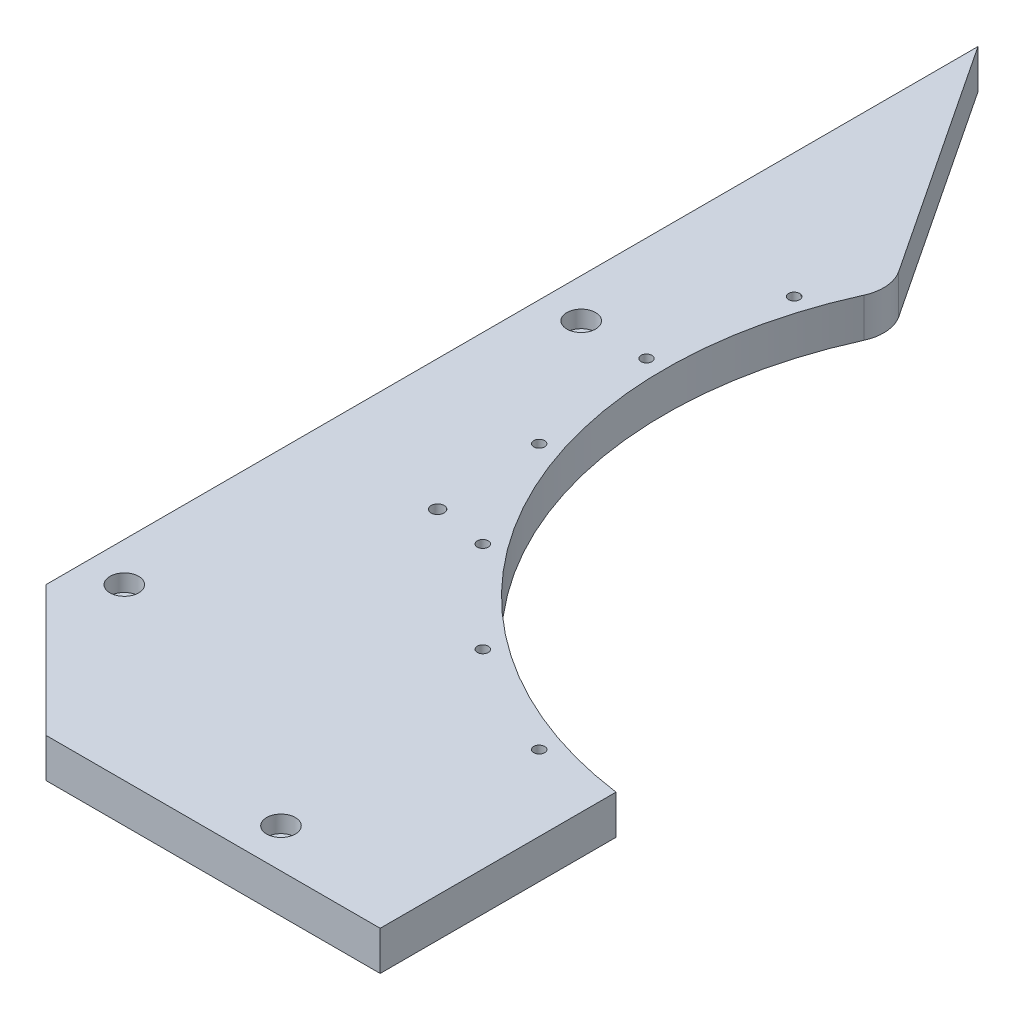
ISO-10303-21;
HEADER;
FILE_DESCRIPTION(('STEP AP214'),'2;1');
FILE_NAME('part.step','',(''),(''),'','','');
FILE_SCHEMA(('AUTOMOTIVE_DESIGN { 1 0 10303 214 1 1 1 1 }'));
ENDSEC;
DATA;
#1=APPLICATION_CONTEXT('core data for automotive mechanical design processes');
#2=APPLICATION_PROTOCOL_DEFINITION('international standard','automotive_design',2000,#1);
#3=PRODUCT_CONTEXT('',#1,'mechanical');
#4=PRODUCT('Part','Part','',(#3));
#5=PRODUCT_RELATED_PRODUCT_CATEGORY('part','',(#4));
#6=PRODUCT_DEFINITION_FORMATION('','',#4);
#7=PRODUCT_DEFINITION_CONTEXT('part definition',#1,'design');
#8=PRODUCT_DEFINITION('design','',#6,#7);
#9=PRODUCT_DEFINITION_SHAPE('','',#8);
#10=(LENGTH_UNIT() NAMED_UNIT(*) SI_UNIT(.MILLI.,.METRE.));
#11=(NAMED_UNIT(*) PLANE_ANGLE_UNIT() SI_UNIT($,.RADIAN.));
#12=(NAMED_UNIT(*) SI_UNIT($,.STERADIAN.) SOLID_ANGLE_UNIT());
#13=UNCERTAINTY_MEASURE_WITH_UNIT(LENGTH_MEASURE(1.E-05),#10,'distance_accuracy_value','');
#14=(GEOMETRIC_REPRESENTATION_CONTEXT(3) GLOBAL_UNCERTAINTY_ASSIGNED_CONTEXT((#13)) GLOBAL_UNIT_ASSIGNED_CONTEXT((#10,
#11,#12)) REPRESENTATION_CONTEXT('',''));
#15=CARTESIAN_POINT('',(0.,0.,0.));
#16=DIRECTION('',(0.,0.,1.));
#17=DIRECTION('',(1.,0.,0.));
#18=AXIS2_PLACEMENT_3D('',#15,#16,#17);
#19=CARTESIAN_POINT('',(-83.,8.5,59.9999999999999));
#20=DIRECTION('',(0.,1.,0.));
#21=DIRECTION('',(0.,0.,1.));
#22=AXIS2_PLACEMENT_3D('',#19,#20,#21);
#23=CYLINDRICAL_SURFACE('',#22,5.50000000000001);
#24=CARTESIAN_POINT('',(-83.,15.,59.9999999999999));
#25=DIRECTION('',(0.,1.,0.));
#26=DIRECTION('',(0.,0.,1.));
#27=AXIS2_PLACEMENT_3D('',#24,#25,#26);
#28=CIRCLE('',#27,5.50000000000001);
#29=CARTESIAN_POINT('',(-83.,15.,65.4999999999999));
#30=VERTEX_POINT('',#29);
#31=EDGE_CURVE('E199',#30,#30,#28,.F.);
#32=ORIENTED_EDGE('',*,*,#31,.F.);
#33=EDGE_LOOP('',(#32));
#34=FACE_BOUND('',#33,.T.);
#35=CARTESIAN_POINT('',(-83.,8.5,59.9999999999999));
#36=DIRECTION('',(0.,1.,0.));
#37=DIRECTION('',(0.,0.,1.));
#38=AXIS2_PLACEMENT_3D('',#35,#36,#37);
#39=CIRCLE('',#38,5.50000000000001);
#40=CARTESIAN_POINT('',(-83.,8.5,65.4999999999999));
#41=VERTEX_POINT('',#40);
#42=EDGE_CURVE('E202',#41,#41,#39,.T.);
#43=ORIENTED_EDGE('',*,*,#42,.F.);
#44=EDGE_LOOP('',(#43));
#45=FACE_BOUND('',#44,.T.);
#46=ADVANCED_FACE('F17',(#34,#45),#23,.F.);
#47=CARTESIAN_POINT('',(27.,8.5,285.));
#48=DIRECTION('',(0.,1.,0.));
#49=DIRECTION('',(0.,0.,1.));
#50=AXIS2_PLACEMENT_3D('',#47,#48,#49);
#51=CYLINDRICAL_SURFACE('',#50,5.50000000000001);
#52=CARTESIAN_POINT('',(27.,15.,285.));
#53=DIRECTION('',(0.,1.,0.));
#54=DIRECTION('',(0.,0.,1.));
#55=AXIS2_PLACEMENT_3D('',#52,#53,#54);
#56=CIRCLE('',#55,5.50000000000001);
#57=CARTESIAN_POINT('',(27.,15.,290.5));
#58=VERTEX_POINT('',#57);
#59=EDGE_CURVE('E196',#58,#58,#56,.F.);
#60=ORIENTED_EDGE('',*,*,#59,.F.);
#61=EDGE_LOOP('',(#60));
#62=FACE_BOUND('',#61,.T.);
#63=CARTESIAN_POINT('',(27.,8.5,285.));
#64=DIRECTION('',(0.,1.,0.));
#65=DIRECTION('',(0.,0.,1.));
#66=AXIS2_PLACEMENT_3D('',#63,#64,#65);
#67=CIRCLE('',#66,5.50000000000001);
#68=CARTESIAN_POINT('',(27.,8.5,290.5));
#69=VERTEX_POINT('',#68);
#70=EDGE_CURVE('E20',#69,#69,#67,.T.);
#71=ORIENTED_EDGE('',*,*,#70,.F.);
#72=EDGE_LOOP('',(#71));
#73=FACE_BOUND('',#72,.T.);
#74=ADVANCED_FACE('F213',(#62,#73),#51,.F.);
#75=CARTESIAN_POINT('',(-83.,8.5,235.));
#76=DIRECTION('',(0.,1.,0.));
#77=DIRECTION('',(0.,0.,1.));
#78=AXIS2_PLACEMENT_3D('',#75,#76,#77);
#79=CYLINDRICAL_SURFACE('',#78,5.50000000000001);
#80=CARTESIAN_POINT('',(-83.,15.,235.));
#81=DIRECTION('',(0.,1.,0.));
#82=DIRECTION('',(0.,0.,1.));
#83=AXIS2_PLACEMENT_3D('',#80,#81,#82);
#84=CIRCLE('',#83,5.50000000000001);
#85=CARTESIAN_POINT('',(-83.,15.,240.5));
#86=VERTEX_POINT('',#85);
#87=EDGE_CURVE('E193',#86,#86,#84,.F.);
#88=ORIENTED_EDGE('',*,*,#87,.F.);
#89=EDGE_LOOP('',(#88));
#90=FACE_BOUND('',#89,.T.);
#91=CARTESIAN_POINT('',(-83.,8.5,235.));
#92=DIRECTION('',(0.,1.,0.));
#93=DIRECTION('',(0.,0.,1.));
#94=AXIS2_PLACEMENT_3D('',#91,#92,#93);
#95=CIRCLE('',#94,5.50000000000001);
#96=CARTESIAN_POINT('',(-83.,8.5,240.5));
#97=VERTEX_POINT('',#96);
#98=EDGE_CURVE('E204',#97,#97,#95,.T.);
#99=ORIENTED_EDGE('',*,*,#98,.F.);
#100=EDGE_LOOP('',(#99));
#101=FACE_BOUND('',#100,.T.);
#102=ADVANCED_FACE('F215',(#90,#101),#79,.F.);
#103=CARTESIAN_POINT('',(27.,8.5,285.));
#104=DIRECTION('',(0.,1.,0.));
#105=DIRECTION('',(0.,0.,1.));
#106=AXIS2_PLACEMENT_3D('',#103,#104,#105);
#107=PLANE('',#106);
#108=CARTESIAN_POINT('',(27.,8.5,285.));
#109=DIRECTION('',(0.,1.,0.));
#110=DIRECTION('',(0.,0.,1.));
#111=AXIS2_PLACEMENT_3D('',#108,#109,#110);
#112=CIRCLE('',#111,3.25000000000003);
#113=CARTESIAN_POINT('',(27.,8.5,288.25));
#114=VERTEX_POINT('',#113);
#115=EDGE_CURVE('E187',#114,#114,#112,.F.);
#116=ORIENTED_EDGE('',*,*,#115,.T.);
#117=EDGE_LOOP('',(#116));
#118=FACE_BOUND('',#117,.T.);
#119=ORIENTED_EDGE('',*,*,#70,.T.);
#120=EDGE_LOOP('',(#119));
#121=FACE_BOUND('',#120,.T.);
#122=ADVANCED_FACE('F211',(#118,#121),#107,.T.);
#123=CARTESIAN_POINT('',(-83.,8.5,235.));
#124=DIRECTION('',(0.,1.,0.));
#125=DIRECTION('',(0.,0.,1.));
#126=AXIS2_PLACEMENT_3D('',#123,#124,#125);
#127=PLANE('',#126);
#128=CARTESIAN_POINT('',(-83.,8.5,235.));
#129=DIRECTION('',(0.,1.,0.));
#130=DIRECTION('',(0.,0.,1.));
#131=AXIS2_PLACEMENT_3D('',#128,#129,#130);
#132=CIRCLE('',#131,3.25);
#133=CARTESIAN_POINT('',(-83.,8.5,238.25));
#134=VERTEX_POINT('',#133);
#135=EDGE_CURVE('E184',#134,#134,#132,.F.);
#136=ORIENTED_EDGE('',*,*,#135,.T.);
#137=EDGE_LOOP('',(#136));
#138=FACE_BOUND('',#137,.T.);
#139=ORIENTED_EDGE('',*,*,#98,.T.);
#140=EDGE_LOOP('',(#139));
#141=FACE_BOUND('',#140,.T.);
#142=ADVANCED_FACE('F303',(#138,#141),#127,.T.);
#143=CARTESIAN_POINT('',(-83.,8.5,59.9999999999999));
#144=DIRECTION('',(0.,1.,0.));
#145=DIRECTION('',(0.,0.,1.));
#146=AXIS2_PLACEMENT_3D('',#143,#144,#145);
#147=PLANE('',#146);
#148=CARTESIAN_POINT('',(-83.,8.5,59.9999999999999));
#149=DIRECTION('',(0.,1.,0.));
#150=DIRECTION('',(0.,0.,1.));
#151=AXIS2_PLACEMENT_3D('',#148,#149,#150);
#152=CIRCLE('',#151,3.25);
#153=CARTESIAN_POINT('',(-83.,8.5,63.2499999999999));
#154=VERTEX_POINT('',#153);
#155=EDGE_CURVE('E181',#154,#154,#152,.F.);
#156=ORIENTED_EDGE('',*,*,#155,.T.);
#157=EDGE_LOOP('',(#156));
#158=FACE_BOUND('',#157,.T.);
#159=ORIENTED_EDGE('',*,*,#42,.T.);
#160=EDGE_LOOP('',(#159));
#161=FACE_BOUND('',#160,.T.);
#162=ADVANCED_FACE('F300',(#158,#161),#147,.T.);
#163=CARTESIAN_POINT('',(0.,15.,0.));
#164=DIRECTION('',(0.,1.,0.));
#165=DIRECTION('',(0.,0.,1.));
#166=AXIS2_PLACEMENT_3D('',#163,#164,#165);
#167=PLANE('',#166);
#168=DIRECTION('',(-1.,0.,0.));
#169=VECTOR('',#168,1.);
#170=CARTESIAN_POINT('',(0.,15.,300.));
#171=LINE('',#170,#169);
#172=CARTESIAN_POINT('',(-48.,15.,300.));
#173=VERTEX_POINT('',#172);
#174=CARTESIAN_POINT('',(80.,15.,300.));
#175=VERTEX_POINT('',#174);
#176=EDGE_CURVE('E63',#173,#175,#171,.F.);
#177=ORIENTED_EDGE('',*,*,#176,.T.);
#178=DIRECTION('',(0.,0.,1.));
#179=VECTOR('',#178,1.);
#180=CARTESIAN_POINT('',(80.,15.,250.));
#181=LINE('',#180,#179);
#182=CARTESIAN_POINT('',(80.,15.,209.669636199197));
#183=VERTEX_POINT('',#182);
#184=EDGE_CURVE('E56',#175,#183,#181,.F.);
#185=ORIENTED_EDGE('',*,*,#184,.T.);
#186=CARTESIAN_POINT('',(100.,15.,59.9999999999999));
#187=DIRECTION('',(0.,1.,0.));
#188=DIRECTION('',(0.,0.,1.));
#189=AXIS2_PLACEMENT_3D('',#186,#187,#188);
#190=CIRCLE('',#189,151.);
#191=CARTESIAN_POINT('',(-37.3900277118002,15.,-2.64966309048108));
#192=VERTEX_POINT('',#191);
#193=EDGE_CURVE('E162',#183,#192,#190,.F.);
#194=ORIENTED_EDGE('',*,*,#193,.T.);
#195=CARTESIAN_POINT('',(-51.0380437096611,15.,-8.8731395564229));
#196=DIRECTION('',(0.,1.,0.));
#197=DIRECTION('',(0.,0.,1.));
#198=AXIS2_PLACEMENT_3D('',#195,#196,#197);
#199=CIRCLE('',#198,15.);
#200=CARTESIAN_POINT('',(-38.5307250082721,15.,-17.1536575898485));
#201=VERTEX_POINT('',#200);
#202=EDGE_CURVE('E159',#201,#192,#199,.F.);
#203=ORIENTED_EDGE('',*,*,#202,.F.);
#204=DIRECTION('',(0.552034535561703,0.,0.833821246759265));
#205=VECTOR('',#204,1.);
#206=CARTESIAN_POINT('',(-100.,15.,-110.));
#207=LINE('',#206,#205);
#208=CARTESIAN_POINT('',(-98.,15.,-106.979097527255));
#209=VERTEX_POINT('',#208);
#210=EDGE_CURVE('E82',#201,#209,#207,.F.);
#211=ORIENTED_EDGE('',*,*,#210,.T.);
#212=DIRECTION('',(0.,0.,-1.));
#213=VECTOR('',#212,1.);
#214=CARTESIAN_POINT('',(-98.,15.,250.));
#215=LINE('',#214,#213);
#216=CARTESIAN_POINT('',(-98.,15.,250.));
#217=VERTEX_POINT('',#216);
#218=EDGE_CURVE('E77',#209,#217,#215,.F.);
#219=ORIENTED_EDGE('',*,*,#218,.T.);
#220=DIRECTION('',(-0.707106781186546,0.,-0.707106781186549));
#221=VECTOR('',#220,1.);
#222=CARTESIAN_POINT('',(-48.0000000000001,15.,300.));
#223=LINE('',#222,#221);
#224=EDGE_CURVE('E81',#217,#173,#223,.F.);
#225=ORIENTED_EDGE('',*,*,#224,.T.);
#226=EDGE_LOOP('',(#177,#185,#194,#203,#211,#219,#225));
#227=FACE_BOUND('',#226,.T.);
#228=CARTESIAN_POINT('',(-50.2669295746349,15.,11.1753148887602));
#229=DIRECTION('',(0.,-1.,0.));
#230=DIRECTION('',(0.,0.,-1.));
#231=AXIS2_PLACEMENT_3D('',#228,#229,#230);
#232=CIRCLE('',#231,2.09999999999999);
#233=CARTESIAN_POINT('',(-50.2669295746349,15.,9.07531488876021));
#234=VERTEX_POINT('',#233);
#235=EDGE_CURVE('E88',#234,#234,#232,.T.);
#236=ORIENTED_EDGE('',*,*,#235,.T.);
#237=EDGE_LOOP('',(#236));
#238=FACE_BOUND('',#237,.T.);
#239=CARTESIAN_POINT('',(-58.,15.,59.9999999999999));
#240=DIRECTION('',(0.,-1.,0.));
#241=DIRECTION('',(0.,0.,-1.));
#242=AXIS2_PLACEMENT_3D('',#239,#240,#241);
#243=CIRCLE('',#242,2.09999999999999);
#244=CARTESIAN_POINT('',(-58.,15.,57.8999999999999));
#245=VERTEX_POINT('',#244);
#246=EDGE_CURVE('E166',#245,#245,#243,.T.);
#247=ORIENTED_EDGE('',*,*,#246,.T.);
#248=EDGE_LOOP('',(#247));
#249=FACE_BOUND('',#248,.T.);
#250=CARTESIAN_POINT('',(-50.2669295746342,15.,108.824685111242));
#251=DIRECTION('',(0.,-1.,0.));
#252=DIRECTION('',(0.,0.,-1.));
#253=AXIS2_PLACEMENT_3D('',#250,#251,#252);
#254=CIRCLE('',#253,2.09999999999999);
#255=CARTESIAN_POINT('',(-50.2669295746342,15.,106.724685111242));
#256=VERTEX_POINT('',#255);
#257=EDGE_CURVE('E169',#256,#256,#254,.T.);
#258=ORIENTED_EDGE('',*,*,#257,.T.);
#259=EDGE_LOOP('',(#258));
#260=FACE_BOUND('',#259,.T.);
#261=CARTESIAN_POINT('',(-27.8246851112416,15.,152.870069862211));
#262=DIRECTION('',(0.,-1.,0.));
#263=DIRECTION('',(0.,0.,-1.));
#264=AXIS2_PLACEMENT_3D('',#261,#262,#263);
#265=CIRCLE('',#264,2.09999999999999);
#266=CARTESIAN_POINT('',(-27.8246851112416,15.,150.770069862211));
#267=VERTEX_POINT('',#266);
#268=EDGE_CURVE('E172',#267,#267,#265,.T.);
#269=ORIENTED_EDGE('',*,*,#268,.T.);
#270=EDGE_LOOP('',(#269));
#271=FACE_BOUND('',#270,.T.);
#272=CARTESIAN_POINT('',(7.12993013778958,15.,187.824685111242));
#273=DIRECTION('',(0.,-1.,0.));
#274=DIRECTION('',(0.,0.,-1.));
#275=AXIS2_PLACEMENT_3D('',#272,#273,#274);
#276=CIRCLE('',#275,2.09999999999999);
#277=CARTESIAN_POINT('',(7.12993013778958,15.,185.724685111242));
#278=VERTEX_POINT('',#277);
#279=EDGE_CURVE('E175',#278,#278,#276,.T.);
#280=ORIENTED_EDGE('',*,*,#279,.T.);
#281=EDGE_LOOP('',(#280));
#282=FACE_BOUND('',#281,.T.);
#283=CARTESIAN_POINT('',(51.1753148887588,15.,210.266929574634));
#284=DIRECTION('',(0.,-1.,0.));
#285=DIRECTION('',(0.,0.,-1.));
#286=AXIS2_PLACEMENT_3D('',#283,#284,#285);
#287=CIRCLE('',#286,2.09999999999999);
#288=CARTESIAN_POINT('',(51.1753148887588,15.,208.166929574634));
#289=VERTEX_POINT('',#288);
#290=EDGE_CURVE('E178',#289,#289,#287,.T.);
#291=ORIENTED_EDGE('',*,*,#290,.T.);
#292=EDGE_LOOP('',(#291));
#293=FACE_BOUND('',#292,.T.);
#294=ORIENTED_EDGE('',*,*,#87,.T.);
#295=EDGE_LOOP('',(#294));
#296=FACE_BOUND('',#295,.T.);
#297=ORIENTED_EDGE('',*,*,#59,.T.);
#298=EDGE_LOOP('',(#297));
#299=FACE_BOUND('',#298,.T.);
#300=ORIENTED_EDGE('',*,*,#31,.T.);
#301=EDGE_LOOP('',(#300));
#302=FACE_BOUND('',#301,.T.);
#303=CARTESIAN_POINT('',(-48.,15.,150.));
#304=DIRECTION('',(0.,1.,0.));
#305=DIRECTION('',(0.,0.,1.));
#306=AXIS2_PLACEMENT_3D('',#303,#304,#305);
#307=CIRCLE('',#306,2.49999999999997);
#308=CARTESIAN_POINT('',(-48.,15.,152.5));
#309=VERTEX_POINT('',#308);
#310=EDGE_CURVE('E190',#309,#309,#307,.F.);
#311=ORIENTED_EDGE('',*,*,#310,.T.);
#312=EDGE_LOOP('',(#311));
#313=FACE_BOUND('',#312,.T.);
#314=ADVANCED_FACE('F79',(#227,#238,#249,#260,#271,#282,#293,#296,#299,#302,#313),#167,.T.);
#315=CARTESIAN_POINT('',(-48.,15.,150.));
#316=DIRECTION('',(0.,1.,0.));
#317=DIRECTION('',(0.,0.,1.));
#318=AXIS2_PLACEMENT_3D('',#315,#316,#317);
#319=CYLINDRICAL_SURFACE('',#318,2.49999999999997);
#320=CARTESIAN_POINT('',(-48.,0.,150.));
#321=DIRECTION('',(0.,1.,0.));
#322=DIRECTION('',(0.,0.,1.));
#323=AXIS2_PLACEMENT_3D('',#320,#321,#322);
#324=CIRCLE('',#323,2.49999999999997);
#325=CARTESIAN_POINT('',(-48.,0.,152.5));
#326=VERTEX_POINT('',#325);
#327=EDGE_CURVE('E109',#326,#326,#324,.F.);
#328=ORIENTED_EDGE('',*,*,#327,.T.);
#329=EDGE_LOOP('',(#328));
#330=FACE_BOUND('',#329,.T.);
#331=ORIENTED_EDGE('',*,*,#310,.F.);
#332=EDGE_LOOP('',(#331));
#333=FACE_BOUND('',#332,.T.);
#334=ADVANCED_FACE('F293',(#330,#333),#319,.F.);
#335=CARTESIAN_POINT('',(27.,0.,285.));
#336=DIRECTION('',(0.,1.,0.));
#337=DIRECTION('',(0.,0.,1.));
#338=AXIS2_PLACEMENT_3D('',#335,#336,#337);
#339=CYLINDRICAL_SURFACE('',#338,3.25000000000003);
#340=CARTESIAN_POINT('',(27.,0.,285.));
#341=DIRECTION('',(0.,1.,0.));
#342=DIRECTION('',(0.,0.,1.));
#343=AXIS2_PLACEMENT_3D('',#340,#341,#342);
#344=CIRCLE('',#343,3.25000000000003);
#345=CARTESIAN_POINT('',(27.,0.,288.25));
#346=VERTEX_POINT('',#345);
#347=EDGE_CURVE('E154',#346,#346,#344,.F.);
#348=ORIENTED_EDGE('',*,*,#347,.T.);
#349=EDGE_LOOP('',(#348));
#350=FACE_BOUND('',#349,.T.);
#351=ORIENTED_EDGE('',*,*,#115,.F.);
#352=EDGE_LOOP('',(#351));
#353=FACE_BOUND('',#352,.T.);
#354=ADVANCED_FACE('F289',(#350,#353),#339,.F.);
#355=CARTESIAN_POINT('',(-83.,0.,235.));
#356=DIRECTION('',(0.,1.,0.));
#357=DIRECTION('',(0.,0.,1.));
#358=AXIS2_PLACEMENT_3D('',#355,#356,#357);
#359=CYLINDRICAL_SURFACE('',#358,3.25);
#360=CARTESIAN_POINT('',(-83.,0.,235.));
#361=DIRECTION('',(0.,1.,0.));
#362=DIRECTION('',(0.,0.,1.));
#363=AXIS2_PLACEMENT_3D('',#360,#361,#362);
#364=CIRCLE('',#363,3.25);
#365=CARTESIAN_POINT('',(-83.,0.,238.25));
#366=VERTEX_POINT('',#365);
#367=EDGE_CURVE('E151',#366,#366,#364,.F.);
#368=ORIENTED_EDGE('',*,*,#367,.T.);
#369=EDGE_LOOP('',(#368));
#370=FACE_BOUND('',#369,.T.);
#371=ORIENTED_EDGE('',*,*,#135,.F.);
#372=EDGE_LOOP('',(#371));
#373=FACE_BOUND('',#372,.T.);
#374=ADVANCED_FACE('F285',(#370,#373),#359,.F.);
#375=CARTESIAN_POINT('',(-83.,0.,59.9999999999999));
#376=DIRECTION('',(0.,1.,0.));
#377=DIRECTION('',(0.,0.,1.));
#378=AXIS2_PLACEMENT_3D('',#375,#376,#377);
#379=CYLINDRICAL_SURFACE('',#378,3.25);
#380=CARTESIAN_POINT('',(-83.,0.,59.9999999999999));
#381=DIRECTION('',(0.,1.,0.));
#382=DIRECTION('',(0.,0.,1.));
#383=AXIS2_PLACEMENT_3D('',#380,#381,#382);
#384=CIRCLE('',#383,3.25);
#385=CARTESIAN_POINT('',(-83.,0.,63.2499999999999));
#386=VERTEX_POINT('',#385);
#387=EDGE_CURVE('E148',#386,#386,#384,.F.);
#388=ORIENTED_EDGE('',*,*,#387,.T.);
#389=EDGE_LOOP('',(#388));
#390=FACE_BOUND('',#389,.T.);
#391=ORIENTED_EDGE('',*,*,#155,.F.);
#392=EDGE_LOOP('',(#391));
#393=FACE_BOUND('',#392,.T.);
#394=ADVANCED_FACE('F281',(#390,#393),#379,.F.);
#395=CARTESIAN_POINT('',(51.1753148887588,0.,210.266929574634));
#396=DIRECTION('',(0.,-1.,0.));
#397=DIRECTION('',(0.,0.,-1.));
#398=AXIS2_PLACEMENT_3D('',#395,#396,#397);
#399=CYLINDRICAL_SURFACE('',#398,2.09999999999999);
#400=ORIENTED_EDGE('',*,*,#290,.F.);
#401=EDGE_LOOP('',(#400));
#402=FACE_BOUND('',#401,.T.);
#403=CARTESIAN_POINT('',(51.1753148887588,0.,210.266929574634));
#404=DIRECTION('',(0.,-1.,0.));
#405=DIRECTION('',(0.,0.,-1.));
#406=AXIS2_PLACEMENT_3D('',#403,#404,#405);
#407=CIRCLE('',#406,2.09999999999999);
#408=CARTESIAN_POINT('',(51.1753148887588,0.,208.166929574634));
#409=VERTEX_POINT('',#408);
#410=EDGE_CURVE('E145',#409,#409,#407,.T.);
#411=ORIENTED_EDGE('',*,*,#410,.T.);
#412=EDGE_LOOP('',(#411));
#413=FACE_BOUND('',#412,.T.);
#414=ADVANCED_FACE('F277',(#402,#413),#399,.F.);
#415=CARTESIAN_POINT('',(7.12993013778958,0.,187.824685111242));
#416=DIRECTION('',(0.,-1.,0.));
#417=DIRECTION('',(0.,0.,-1.));
#418=AXIS2_PLACEMENT_3D('',#415,#416,#417);
#419=CYLINDRICAL_SURFACE('',#418,2.09999999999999);
#420=ORIENTED_EDGE('',*,*,#279,.F.);
#421=EDGE_LOOP('',(#420));
#422=FACE_BOUND('',#421,.T.);
#423=CARTESIAN_POINT('',(7.12993013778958,0.,187.824685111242));
#424=DIRECTION('',(0.,-1.,0.));
#425=DIRECTION('',(0.,0.,-1.));
#426=AXIS2_PLACEMENT_3D('',#423,#424,#425);
#427=CIRCLE('',#426,2.09999999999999);
#428=CARTESIAN_POINT('',(7.12993013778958,0.,185.724685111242));
#429=VERTEX_POINT('',#428);
#430=EDGE_CURVE('E142',#429,#429,#427,.T.);
#431=ORIENTED_EDGE('',*,*,#430,.T.);
#432=EDGE_LOOP('',(#431));
#433=FACE_BOUND('',#432,.T.);
#434=ADVANCED_FACE('F273',(#422,#433),#419,.F.);
#435=CARTESIAN_POINT('',(-27.8246851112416,0.,152.870069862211));
#436=DIRECTION('',(0.,-1.,0.));
#437=DIRECTION('',(0.,0.,-1.));
#438=AXIS2_PLACEMENT_3D('',#435,#436,#437);
#439=CYLINDRICAL_SURFACE('',#438,2.09999999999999);
#440=ORIENTED_EDGE('',*,*,#268,.F.);
#441=EDGE_LOOP('',(#440));
#442=FACE_BOUND('',#441,.T.);
#443=CARTESIAN_POINT('',(-27.8246851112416,0.,152.870069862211));
#444=DIRECTION('',(0.,-1.,0.));
#445=DIRECTION('',(0.,0.,-1.));
#446=AXIS2_PLACEMENT_3D('',#443,#444,#445);
#447=CIRCLE('',#446,2.09999999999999);
#448=CARTESIAN_POINT('',(-27.8246851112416,0.,150.770069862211));
#449=VERTEX_POINT('',#448);
#450=EDGE_CURVE('E139',#449,#449,#447,.T.);
#451=ORIENTED_EDGE('',*,*,#450,.T.);
#452=EDGE_LOOP('',(#451));
#453=FACE_BOUND('',#452,.T.);
#454=ADVANCED_FACE('F269',(#442,#453),#439,.F.);
#455=CARTESIAN_POINT('',(-50.2669295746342,0.,108.824685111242));
#456=DIRECTION('',(0.,-1.,0.));
#457=DIRECTION('',(0.,0.,-1.));
#458=AXIS2_PLACEMENT_3D('',#455,#456,#457);
#459=CYLINDRICAL_SURFACE('',#458,2.09999999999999);
#460=ORIENTED_EDGE('',*,*,#257,.F.);
#461=EDGE_LOOP('',(#460));
#462=FACE_BOUND('',#461,.T.);
#463=CARTESIAN_POINT('',(-50.2669295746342,0.,108.824685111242));
#464=DIRECTION('',(0.,-1.,0.));
#465=DIRECTION('',(0.,0.,-1.));
#466=AXIS2_PLACEMENT_3D('',#463,#464,#465);
#467=CIRCLE('',#466,2.09999999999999);
#468=CARTESIAN_POINT('',(-50.2669295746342,0.,106.724685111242));
#469=VERTEX_POINT('',#468);
#470=EDGE_CURVE('E136',#469,#469,#467,.T.);
#471=ORIENTED_EDGE('',*,*,#470,.T.);
#472=EDGE_LOOP('',(#471));
#473=FACE_BOUND('',#472,.T.);
#474=ADVANCED_FACE('F265',(#462,#473),#459,.F.);
#475=CARTESIAN_POINT('',(-58.,0.,59.9999999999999));
#476=DIRECTION('',(0.,-1.,0.));
#477=DIRECTION('',(0.,0.,-1.));
#478=AXIS2_PLACEMENT_3D('',#475,#476,#477);
#479=CYLINDRICAL_SURFACE('',#478,2.09999999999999);
#480=ORIENTED_EDGE('',*,*,#246,.F.);
#481=EDGE_LOOP('',(#480));
#482=FACE_BOUND('',#481,.T.);
#483=CARTESIAN_POINT('',(-58.,0.,59.9999999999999));
#484=DIRECTION('',(0.,-1.,0.));
#485=DIRECTION('',(0.,0.,-1.));
#486=AXIS2_PLACEMENT_3D('',#483,#484,#485);
#487=CIRCLE('',#486,2.09999999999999);
#488=CARTESIAN_POINT('',(-58.,0.,57.8999999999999));
#489=VERTEX_POINT('',#488);
#490=EDGE_CURVE('E133',#489,#489,#487,.T.);
#491=ORIENTED_EDGE('',*,*,#490,.T.);
#492=EDGE_LOOP('',(#491));
#493=FACE_BOUND('',#492,.T.);
#494=ADVANCED_FACE('F261',(#482,#493),#479,.F.);
#495=CARTESIAN_POINT('',(-50.2669295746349,0.,11.1753148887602));
#496=DIRECTION('',(0.,-1.,0.));
#497=DIRECTION('',(0.,0.,-1.));
#498=AXIS2_PLACEMENT_3D('',#495,#496,#497);
#499=CYLINDRICAL_SURFACE('',#498,2.09999999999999);
#500=ORIENTED_EDGE('',*,*,#235,.F.);
#501=EDGE_LOOP('',(#500));
#502=FACE_BOUND('',#501,.T.);
#503=CARTESIAN_POINT('',(-50.2669295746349,0.,11.1753148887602));
#504=DIRECTION('',(0.,-1.,0.));
#505=DIRECTION('',(0.,0.,-1.));
#506=AXIS2_PLACEMENT_3D('',#503,#504,#505);
#507=CIRCLE('',#506,2.09999999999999);
#508=CARTESIAN_POINT('',(-50.2669295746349,0.,9.07531488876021));
#509=VERTEX_POINT('',#508);
#510=EDGE_CURVE('E130',#509,#509,#507,.T.);
#511=ORIENTED_EDGE('',*,*,#510,.T.);
#512=EDGE_LOOP('',(#511));
#513=FACE_BOUND('',#512,.T.);
#514=ADVANCED_FACE('F258',(#502,#513),#499,.F.);
#515=CARTESIAN_POINT('',(-98.,0.,250.));
#516=DIRECTION('',(1.,0.,0.));
#517=DIRECTION('',(0.,0.,-1.));
#518=AXIS2_PLACEMENT_3D('',#515,#516,#517);
#519=PLANE('',#518);
#520=DIRECTION('',(0.,1.,0.));
#521=VECTOR('',#520,1.);
#522=CARTESIAN_POINT('',(-98.,0.,250.));
#523=LINE('',#522,#521);
#524=CARTESIAN_POINT('',(-98.,0.,250.));
#525=VERTEX_POINT('',#524);
#526=EDGE_CURVE('E87',#525,#217,#523,.T.);
#527=ORIENTED_EDGE('',*,*,#526,.T.);
#528=ORIENTED_EDGE('',*,*,#218,.F.);
#529=DIRECTION('',(0.,1.,0.));
#530=VECTOR('',#529,1.);
#531=CARTESIAN_POINT('',(-98.,0.,-106.979097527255));
#532=LINE('',#531,#530);
#533=CARTESIAN_POINT('',(-98.,0.,-106.979097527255));
#534=VERTEX_POINT('',#533);
#535=EDGE_CURVE('E580',#209,#534,#532,.F.);
#536=ORIENTED_EDGE('',*,*,#535,.T.);
#537=DIRECTION('',(0.,0.,1.));
#538=VECTOR('',#537,1.);
#539=CARTESIAN_POINT('',(-98.,0.,0.));
#540=LINE('',#539,#538);
#541=EDGE_CURVE('E100',#534,#525,#540,.T.);
#542=ORIENTED_EDGE('',*,*,#541,.T.);
#543=EDGE_LOOP('',(#527,#528,#536,#542));
#544=FACE_BOUND('',#543,.T.);
#545=ADVANCED_FACE('F98',(#544),#519,.F.);
#546=CARTESIAN_POINT('',(-48.0000000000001,0.,300.));
#547=DIRECTION('',(0.707106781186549,0.,-0.707106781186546));
#548=DIRECTION('',(-0.707106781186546,0.,-0.707106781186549));
#549=AXIS2_PLACEMENT_3D('',#546,#547,#548);
#550=PLANE('',#549);
#551=ORIENTED_EDGE('',*,*,#526,.F.);
#552=DIRECTION('',(0.707106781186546,0.,0.707106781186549));
#553=VECTOR('',#552,1.);
#554=CARTESIAN_POINT('',(-98.,0.,250.));
#555=LINE('',#554,#553);
#556=CARTESIAN_POINT('',(-48.,0.,300.));
#557=VERTEX_POINT('',#556);
#558=EDGE_CURVE('E564',#525,#557,#555,.T.);
#559=ORIENTED_EDGE('',*,*,#558,.T.);
#560=DIRECTION('',(0.,1.,0.));
#561=VECTOR('',#560,1.);
#562=CARTESIAN_POINT('',(-48.,0.,300.));
#563=LINE('',#562,#561);
#564=EDGE_CURVE('E95',#557,#173,#563,.T.);
#565=ORIENTED_EDGE('',*,*,#564,.T.);
#566=ORIENTED_EDGE('',*,*,#224,.F.);
#567=EDGE_LOOP('',(#551,#559,#565,#566));
#568=FACE_BOUND('',#567,.T.);
#569=ADVANCED_FACE('F92',(#568),#550,.F.);
#570=CARTESIAN_POINT('',(0.,0.,300.));
#571=DIRECTION('',(0.,0.,-1.));
#572=DIRECTION('',(-1.,0.,0.));
#573=AXIS2_PLACEMENT_3D('',#570,#571,#572);
#574=PLANE('',#573);
#575=ORIENTED_EDGE('',*,*,#564,.F.);
#576=DIRECTION('',(1.,0.,0.));
#577=VECTOR('',#576,1.);
#578=CARTESIAN_POINT('',(0.,0.,300.));
#579=LINE('',#578,#577);
#580=CARTESIAN_POINT('',(80.,0.,300.));
#581=VERTEX_POINT('',#580);
#582=EDGE_CURVE('E561',#557,#581,#579,.T.);
#583=ORIENTED_EDGE('',*,*,#582,.T.);
#584=DIRECTION('',(0.,1.,0.));
#585=VECTOR('',#584,1.);
#586=CARTESIAN_POINT('',(80.,0.,300.));
#587=LINE('',#586,#585);
#588=EDGE_CURVE('E116',#581,#175,#587,.T.);
#589=ORIENTED_EDGE('',*,*,#588,.T.);
#590=ORIENTED_EDGE('',*,*,#176,.F.);
#591=EDGE_LOOP('',(#575,#583,#589,#590));
#592=FACE_BOUND('',#591,.T.);
#593=ADVANCED_FACE('F249',(#592),#574,.F.);
#594=CARTESIAN_POINT('',(80.,0.,250.));
#595=DIRECTION('',(-1.,0.,0.));
#596=DIRECTION('',(0.,0.,1.));
#597=AXIS2_PLACEMENT_3D('',#594,#595,#596);
#598=PLANE('',#597);
#599=ORIENTED_EDGE('',*,*,#588,.F.);
#600=DIRECTION('',(0.,0.,1.));
#601=VECTOR('',#600,1.);
#602=CARTESIAN_POINT('',(80.,0.,0.));
#603=LINE('',#602,#601);
#604=CARTESIAN_POINT('',(80.,0.,209.669636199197));
#605=VERTEX_POINT('',#604);
#606=EDGE_CURVE('E129',#581,#605,#603,.F.);
#607=ORIENTED_EDGE('',*,*,#606,.T.);
#608=DIRECTION('',(0.,1.,0.));
#609=VECTOR('',#608,1.);
#610=CARTESIAN_POINT('',(80.,0.,209.669636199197));
#611=LINE('',#610,#609);
#612=EDGE_CURVE('E115',#605,#183,#611,.T.);
#613=ORIENTED_EDGE('',*,*,#612,.T.);
#614=ORIENTED_EDGE('',*,*,#184,.F.);
#615=EDGE_LOOP('',(#599,#607,#613,#614));
#616=FACE_BOUND('',#615,.T.);
#617=ADVANCED_FACE('F245',(#616),#598,.F.);
#618=CARTESIAN_POINT('',(100.,0.,59.9999999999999));
#619=DIRECTION('',(0.,1.,0.));
#620=DIRECTION('',(0.,0.,1.));
#621=AXIS2_PLACEMENT_3D('',#618,#619,#620);
#622=CYLINDRICAL_SURFACE('',#621,151.);
#623=DIRECTION('',(0.,1.,0.));
#624=VECTOR('',#623,1.);
#625=CARTESIAN_POINT('',(-37.3900277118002,0.,-2.64966309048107));
#626=LINE('',#625,#624);
#627=CARTESIAN_POINT('',(-37.3900277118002,0.,-2.64966309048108));
#628=VERTEX_POINT('',#627);
#629=EDGE_CURVE('E161',#192,#628,#626,.F.);
#630=ORIENTED_EDGE('',*,*,#629,.F.);
#631=ORIENTED_EDGE('',*,*,#193,.F.);
#632=ORIENTED_EDGE('',*,*,#612,.F.);
#633=CARTESIAN_POINT('',(100.,0.,59.9999999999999));
#634=DIRECTION('',(0.,1.,0.));
#635=DIRECTION('',(0.,0.,1.));
#636=AXIS2_PLACEMENT_3D('',#633,#634,#635);
#637=CIRCLE('',#636,151.);
#638=EDGE_CURVE('E126',#605,#628,#637,.F.);
#639=ORIENTED_EDGE('',*,*,#638,.T.);
#640=EDGE_LOOP('',(#630,#631,#632,#639));
#641=FACE_BOUND('',#640,.T.);
#642=ADVANCED_FACE('F241',(#641),#622,.F.);
#643=CARTESIAN_POINT('',(-51.0380437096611,0.,-8.8731395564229));
#644=DIRECTION('',(0.,1.,0.));
#645=DIRECTION('',(0.,0.,1.));
#646=AXIS2_PLACEMENT_3D('',#643,#644,#645);
#647=CYLINDRICAL_SURFACE('',#646,15.);
#648=ORIENTED_EDGE('',*,*,#202,.T.);
#649=ORIENTED_EDGE('',*,*,#629,.T.);
#650=CARTESIAN_POINT('',(-51.0380437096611,0.,-8.8731395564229));
#651=DIRECTION('',(0.,1.,0.));
#652=DIRECTION('',(0.,0.,1.));
#653=AXIS2_PLACEMENT_3D('',#650,#651,#652);
#654=CIRCLE('',#653,15.);
#655=CARTESIAN_POINT('',(-38.5307250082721,0.,-17.1536575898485));
#656=VERTEX_POINT('',#655);
#657=EDGE_CURVE('E26',#628,#656,#654,.T.);
#658=ORIENTED_EDGE('',*,*,#657,.T.);
#659=DIRECTION('',(0.,1.,0.));
#660=VECTOR('',#659,1.);
#661=CARTESIAN_POINT('',(-38.5307250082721,0.,-17.1536575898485));
#662=LINE('',#661,#660);
#663=EDGE_CURVE('E34',#656,#201,#662,.T.);
#664=ORIENTED_EDGE('',*,*,#663,.T.);
#665=EDGE_LOOP('',(#648,#649,#658,#664));
#666=FACE_BOUND('',#665,.T.);
#667=ADVANCED_FACE('F234',(#666),#647,.T.);
#668=CARTESIAN_POINT('',(-100.,0.,-110.));
#669=DIRECTION('',(-0.833821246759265,0.,0.552034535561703));
#670=DIRECTION('',(0.552034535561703,0.,0.833821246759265));
#671=AXIS2_PLACEMENT_3D('',#668,#669,#670);
#672=PLANE('',#671);
#673=ORIENTED_EDGE('',*,*,#663,.F.);
#674=DIRECTION('',(-0.552034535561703,0.,-0.833821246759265));
#675=VECTOR('',#674,1.);
#676=CARTESIAN_POINT('',(-38.5307250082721,0.,-17.1536575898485));
#677=LINE('',#676,#675);
#678=EDGE_CURVE('E11',#656,#534,#677,.T.);
#679=ORIENTED_EDGE('',*,*,#678,.T.);
#680=ORIENTED_EDGE('',*,*,#535,.F.);
#681=ORIENTED_EDGE('',*,*,#210,.F.);
#682=EDGE_LOOP('',(#673,#679,#680,#681));
#683=FACE_BOUND('',#682,.T.);
#684=ADVANCED_FACE('F228',(#683),#672,.F.);
#685=CARTESIAN_POINT('',(0.,0.,0.));
#686=DIRECTION('',(0.,1.,0.));
#687=DIRECTION('',(0.,0.,1.));
#688=AXIS2_PLACEMENT_3D('',#685,#686,#687);
#689=PLANE('',#688);
#690=ORIENTED_EDGE('',*,*,#657,.F.);
#691=ORIENTED_EDGE('',*,*,#638,.F.);
#692=ORIENTED_EDGE('',*,*,#606,.F.);
#693=ORIENTED_EDGE('',*,*,#582,.F.);
#694=ORIENTED_EDGE('',*,*,#558,.F.);
#695=ORIENTED_EDGE('',*,*,#541,.F.);
#696=ORIENTED_EDGE('',*,*,#678,.F.);
#697=EDGE_LOOP('',(#690,#691,#692,#693,#694,#695,#696));
#698=FACE_BOUND('',#697,.T.);
#699=ORIENTED_EDGE('',*,*,#510,.F.);
#700=EDGE_LOOP('',(#699));
#701=FACE_BOUND('',#700,.T.);
#702=ORIENTED_EDGE('',*,*,#490,.F.);
#703=EDGE_LOOP('',(#702));
#704=FACE_BOUND('',#703,.T.);
#705=ORIENTED_EDGE('',*,*,#470,.F.);
#706=EDGE_LOOP('',(#705));
#707=FACE_BOUND('',#706,.T.);
#708=ORIENTED_EDGE('',*,*,#450,.F.);
#709=EDGE_LOOP('',(#708));
#710=FACE_BOUND('',#709,.T.);
#711=ORIENTED_EDGE('',*,*,#430,.F.);
#712=EDGE_LOOP('',(#711));
#713=FACE_BOUND('',#712,.T.);
#714=ORIENTED_EDGE('',*,*,#410,.F.);
#715=EDGE_LOOP('',(#714));
#716=FACE_BOUND('',#715,.T.);
#717=ORIENTED_EDGE('',*,*,#387,.F.);
#718=EDGE_LOOP('',(#717));
#719=FACE_BOUND('',#718,.T.);
#720=ORIENTED_EDGE('',*,*,#367,.F.);
#721=EDGE_LOOP('',(#720));
#722=FACE_BOUND('',#721,.T.);
#723=ORIENTED_EDGE('',*,*,#347,.F.);
#724=EDGE_LOOP('',(#723));
#725=FACE_BOUND('',#724,.T.);
#726=ORIENTED_EDGE('',*,*,#327,.F.);
#727=EDGE_LOOP('',(#726));
#728=FACE_BOUND('',#727,.T.);
#729=ADVANCED_FACE('F226',(#698,#701,#704,#707,#710,#713,#716,#719,#722,#725,#728),#689,.F.);
#730=CLOSED_SHELL('',(#46,#74,#102,#122,#142,#162,#314,#334,#354,#374,#394,#414,#434,#454,#474,
#494,#514,#545,#569,#593,#617,#642,#667,#684,#729));
#731=MANIFOLD_SOLID_BREP('B1',#730);
#732=ADVANCED_BREP_SHAPE_REPRESENTATION('',(#18,#731),#14);
#733=SHAPE_DEFINITION_REPRESENTATION(#9,#732);
ENDSEC;
END-ISO-10303-21;
